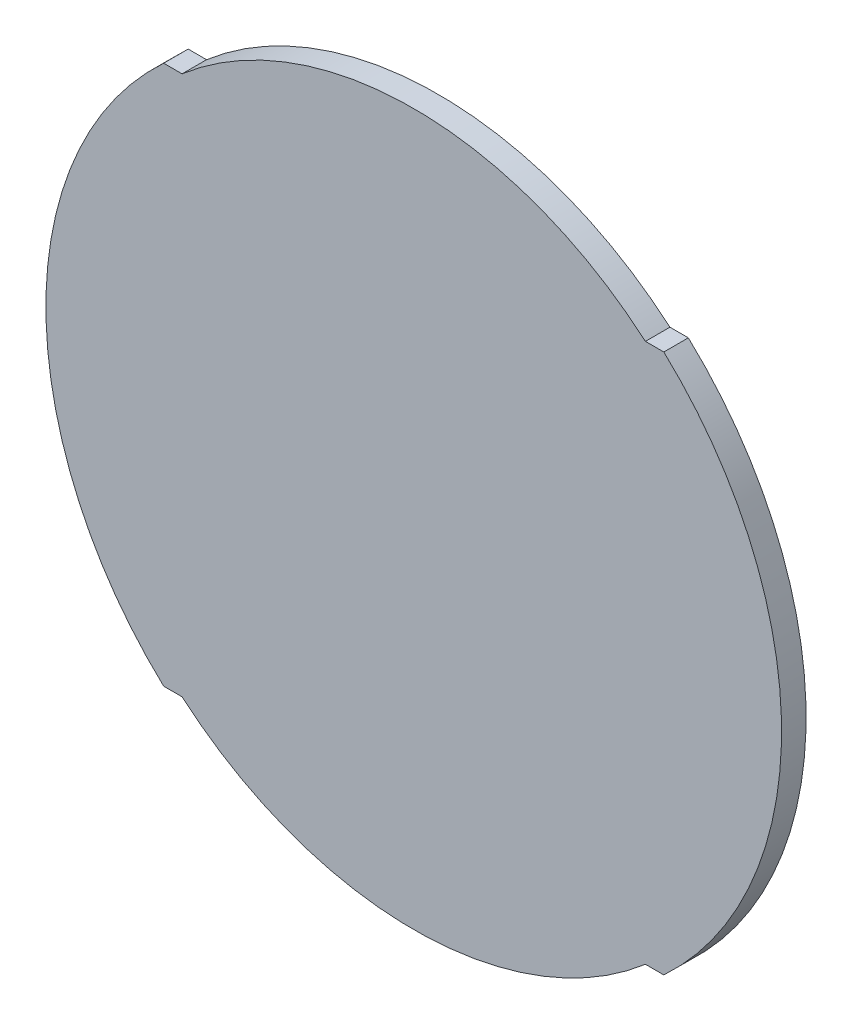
from build123d import *

# Parameters (mm, degrees)
BASE_EXTRUSION_DEPTH = 1.5


with BuildPart() as part:
    # Esquisse2 → Base-Extrusion (new body)
    with BuildSketch(Plane.XY):
        with BuildLine():
            Line((-15.297058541, 16.5), (-14.170832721, 16.5))
            ThreePointArc((-14.170832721, 16.5), (0, 21.75), (14.170832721, 16.5))
            Line((14.170832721, 16.5), (15.297058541, 16.5))
            ThreePointArc((15.297058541, 16.5), (22.5, 0), (15.297058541, -16.5))
            Line((15.297058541, -16.5), (14.170832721, -16.5))
            ThreePointArc((14.170832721, -16.5), (0, -21.75), (-14.170832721, -16.5))
            Line((-14.170832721, -16.5), (-15.297058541, -16.5))
            ThreePointArc((-15.297058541, -16.5), (-22.5, 0), (-15.297058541, 16.5))
        make_face()
    extrude(amount=BASE_EXTRUSION_DEPTH)


solid = part.part
